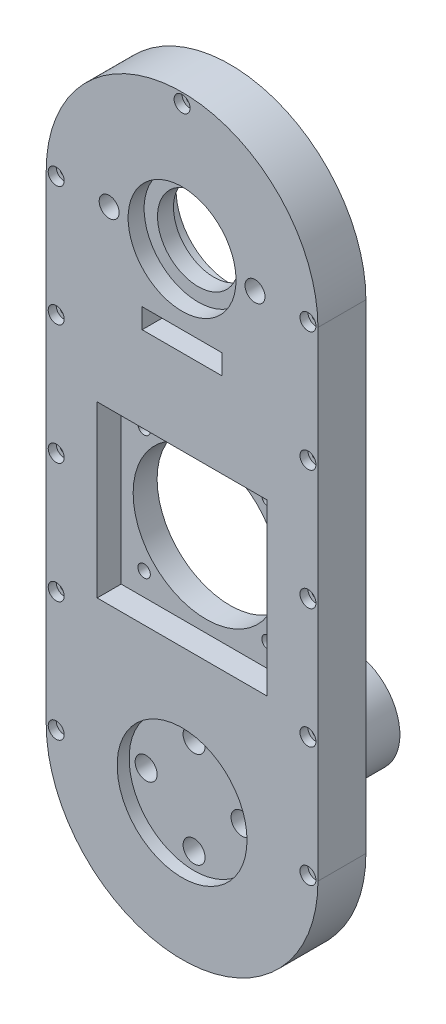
from build123d import *

# Parameters (mm, degrees)
BOSS_EXTRUDE1_DEPTH = 12
SKETCH2_R           = 16.25
CUT_EXTRUDE1_DEPTH  = 3
SKETCH3_R           = 2.75
CUT_EXTRUDE2_DEPTH  = 5
SKETCH4_R           = 12.5
BOSS_EXTRUDE2_DEPTH = 30
CUT_EXTRUDE9_REACH  = 110.425
SKETCH12_R          = 1.55
SKETCH12_R_2        = 18.25
SKETCH13_R          = 3
CUT_EXTRUDE10_DEPTH = 3
CUT_EXTRUDE11_REACH = 110.425
SKETCH14_R          = 10.15
SKETCH15_R          = 13.5
CUT_EXTRUDE12_DEPTH = 4
CUT_EXTRUDE17_REACH = 110.425
SKETCH19_R          = 1
CUT_EXTRUDE18_START = 12
SKETCH20_R          = 2
CUT_EXTRUDE18_DEPTH = 2
CUT_EXTRUDE19_REACH = 110.425
SKETCH21_R          = 2.5
SKETCH22_W          = 42.5
SKETCH22_H          = 42.5
CUT_EXTRUDE20_DEPTH = 6
CUT_EXTRUDE21_REACH = 106.365
SKETCH23_W          = 20
SKETCH23_H          = 5


with BuildPart() as part:
    # Sketch1 → Boss-Extrude1 (new body)
    with BuildSketch(Plane.XY):
        with BuildLine():
            Line((-34, -60), (-34, 60))
            ThreePointArc((-34, 60), (0, 94), (34, 60))
            Line((34, 60), (34, -60))
            ThreePointArc((34, -60), (0, -94), (-34, -60))
        make_face()
    extrude(amount=BOSS_EXTRUDE1_DEPTH)

    # Sketch2 → Cut-Extrude1 (cut)
    with BuildSketch(Plane.XY.offset(12)):
        with Locations((0, -60)):
            Circle(SKETCH2_R)
    extrude(amount=-CUT_EXTRUDE1_DEPTH, mode=Mode.SUBTRACT)

    # Sketch3 → Cut-Extrude2 (cut)
    with BuildSketch(Plane.XY.offset(9)):
        with Locations((0, -48)):
            Circle(SKETCH3_R)
        with Locations((12, -60)):
            Circle(SKETCH3_R)
        with Locations((0, -72)):
            Circle(SKETCH3_R)
        with Locations((-12, -60)):
            Circle(SKETCH3_R)
    extrude(amount=-CUT_EXTRUDE2_DEPTH, mode=Mode.SUBTRACT)

    # Sketch4 → Boss-Extrude2 (add)
    with BuildSketch(Plane(origin=(0, 0, 0), x_dir=(-1, 0, 0), z_dir=(0, 0, -1))):
        with Locations((0, -60)):
            Circle(SKETCH4_R)
    extrude(amount=BOSS_EXTRUDE2_DEPTH)

    # Sketch12 → Cut-Extrude9 (cut, up to next)
    with BuildSketch(Plane.XY.offset(12), mode=Mode.PRIVATE) as cut_extrude9_sk1:
        with Locations((-15.5, 10.5)):
            Circle(SKETCH12_R)
    cut_extrude9_tool1 = extrude(cut_extrude9_sk1.sketch, amount=-CUT_EXTRUDE9_REACH, mode=Mode.PRIVATE) & part.part
    # Sketch12 → Cut-Extrude9 (cut, up to next)
    with BuildSketch(Plane.XY.offset(12), mode=Mode.PRIVATE) as cut_extrude9_sk2:
        with Locations((15.5, 10.5)):
            Circle(SKETCH12_R)
    cut_extrude9_tool2 = extrude(cut_extrude9_sk2.sketch, amount=-CUT_EXTRUDE9_REACH, mode=Mode.PRIVATE) & part.part
    # Sketch12 → Cut-Extrude9 (cut, up to next)
    with BuildSketch(Plane.XY.offset(12), mode=Mode.PRIVATE) as cut_extrude9_sk3:
        with Locations((15.5, -20.5)):
            Circle(SKETCH12_R)
    cut_extrude9_tool3 = extrude(cut_extrude9_sk3.sketch, amount=-CUT_EXTRUDE9_REACH, mode=Mode.PRIVATE) & part.part
    # Sketch12 → Cut-Extrude9 (cut, up to next)
    with BuildSketch(Plane.XY.offset(12), mode=Mode.PRIVATE) as cut_extrude9_sk4:
        with Locations((-15.5, -20.5)):
            Circle(SKETCH12_R)
    cut_extrude9_tool4 = extrude(cut_extrude9_sk4.sketch, amount=-CUT_EXTRUDE9_REACH, mode=Mode.PRIVATE) & part.part
    # Sketch12 → Cut-Extrude9 (cut, up to next)
    with BuildSketch(Plane.XY.offset(12), mode=Mode.PRIVATE) as cut_extrude9_sk5:
        with Locations((0, -5)):
            Circle(SKETCH12_R_2)
    cut_extrude9_tool5 = extrude(cut_extrude9_sk5.sketch, amount=-CUT_EXTRUDE9_REACH, mode=Mode.PRIVATE) & part.part
    add(cut_extrude9_tool1.solids().sort_by_distance((-15.5, 10.5, 12))[0], mode=Mode.SUBTRACT)
    add(cut_extrude9_tool2.solids().sort_by_distance((15.5, 10.5, 12))[0], mode=Mode.SUBTRACT)
    add(cut_extrude9_tool3.solids().sort_by_distance((15.5, -20.5, 12))[0], mode=Mode.SUBTRACT)
    add(cut_extrude9_tool4.solids().sort_by_distance((-15.5, -20.5, 12))[0], mode=Mode.SUBTRACT)
    add(cut_extrude9_tool5.solids().sort_by_distance((0, -5, 12))[0], mode=Mode.SUBTRACT)

    # Sketch13 → Cut-Extrude10 (cut)
    with BuildSketch(Plane(origin=(0, 0, 0), x_dir=(-1, 0, 0), z_dir=(0, 0, -1))):
        with Locations((15.5, 10.5)):
            Circle(SKETCH13_R)
        with Locations((15.5, -20.5)):
            Circle(SKETCH13_R)
        with Locations((-15.5, -20.5)):
            Circle(SKETCH13_R)
        with Locations((-15.5, 10.5)):
            Circle(SKETCH13_R)
    extrude(amount=-CUT_EXTRUDE10_DEPTH, mode=Mode.SUBTRACT)

    # Sketch14 → Cut-Extrude11 (cut, up to next)
    with BuildSketch(Plane.XY.offset(12), mode=Mode.PRIVATE) as cut_extrude11_sk1:
        with Locations((0, 60)):
            Circle(SKETCH14_R)
    cut_extrude11_tool1 = extrude(cut_extrude11_sk1.sketch, amount=-CUT_EXTRUDE11_REACH, mode=Mode.PRIVATE) & part.part
    add(cut_extrude11_tool1.solids().sort_by_distance((0, 60, 12))[0], mode=Mode.SUBTRACT)

    # Sketch15 → Cut-Extrude12 (cut)
    with BuildSketch(Plane.XY.offset(12)):
        with Locations((0, 60)):
            Circle(SKETCH15_R)
    cut_extrude12 = extrude(amount=-CUT_EXTRUDE12_DEPTH, mode=Mode.SUBTRACT)

    # Mirror1: Cut-Extrude12 across plane
    add(cut_extrude12.mirror(Plane.XY.offset(6)), mode=Mode.SUBTRACT)

    # Sketch19 → Cut-Extrude17 (cut, up to next)
    with BuildSketch(Plane.XY.offset(12), mode=Mode.PRIVATE) as cut_extrude17_sk1:
        with Locations((0, 91.5)):
            Circle(SKETCH19_R)
    cut_extrude17_tool1 = extrude(cut_extrude17_sk1.sketch, amount=-CUT_EXTRUDE17_REACH, mode=Mode.PRIVATE) & part.part
    # Sketch19 → Cut-Extrude17 (cut, up to next)
    with BuildSketch(Plane.XY.offset(12), mode=Mode.PRIVATE) as cut_extrude17_sk2:
        with Locations((-31.5, 60)):
            Circle(SKETCH19_R)
    cut_extrude17_tool2 = extrude(cut_extrude17_sk2.sketch, amount=-CUT_EXTRUDE17_REACH, mode=Mode.PRIVATE) & part.part
    # Sketch19 → Cut-Extrude17 (cut, up to next)
    with BuildSketch(Plane.XY.offset(12), mode=Mode.PRIVATE) as cut_extrude17_sk3:
        with Locations((31.5, 60)):
            Circle(SKETCH19_R)
    cut_extrude17_tool3 = extrude(cut_extrude17_sk3.sketch, amount=-CUT_EXTRUDE17_REACH, mode=Mode.PRIVATE) & part.part
    # Sketch19 → Cut-Extrude17 (cut, up to next)
    with BuildSketch(Plane.XY.offset(12), mode=Mode.PRIVATE) as cut_extrude17_sk4:
        with Locations((31.5, 30)):
            Circle(SKETCH19_R)
    cut_extrude17_tool4 = extrude(cut_extrude17_sk4.sketch, amount=-CUT_EXTRUDE17_REACH, mode=Mode.PRIVATE) & part.part
    # Sketch19 → Cut-Extrude17 (cut, up to next)
    with BuildSketch(Plane.XY.offset(12), mode=Mode.PRIVATE) as cut_extrude17_sk5:
        with Locations((31.5, 0)):
            Circle(SKETCH19_R)
    cut_extrude17_tool5 = extrude(cut_extrude17_sk5.sketch, amount=-CUT_EXTRUDE17_REACH, mode=Mode.PRIVATE) & part.part
    # Sketch19 → Cut-Extrude17 (cut, up to next)
    with BuildSketch(Plane.XY.offset(12), mode=Mode.PRIVATE) as cut_extrude17_sk6:
        with Locations((31.5, -30)):
            Circle(SKETCH19_R)
    cut_extrude17_tool6 = extrude(cut_extrude17_sk6.sketch, amount=-CUT_EXTRUDE17_REACH, mode=Mode.PRIVATE) & part.part
    # Sketch19 → Cut-Extrude17 (cut, up to next)
    with BuildSketch(Plane.XY.offset(12), mode=Mode.PRIVATE) as cut_extrude17_sk7:
        with Locations((-31.5, 30)):
            Circle(SKETCH19_R)
    cut_extrude17_tool7 = extrude(cut_extrude17_sk7.sketch, amount=-CUT_EXTRUDE17_REACH, mode=Mode.PRIVATE) & part.part
    # Sketch19 → Cut-Extrude17 (cut, up to next)
    with BuildSketch(Plane.XY.offset(12), mode=Mode.PRIVATE) as cut_extrude17_sk8:
        with Locations((-31.5, 0)):
            Circle(SKETCH19_R)
    cut_extrude17_tool8 = extrude(cut_extrude17_sk8.sketch, amount=-CUT_EXTRUDE17_REACH, mode=Mode.PRIVATE) & part.part
    # Sketch19 → Cut-Extrude17 (cut, up to next)
    with BuildSketch(Plane.XY.offset(12), mode=Mode.PRIVATE) as cut_extrude17_sk9:
        with Locations((-31.5, -30)):
            Circle(SKETCH19_R)
    cut_extrude17_tool9 = extrude(cut_extrude17_sk9.sketch, amount=-CUT_EXTRUDE17_REACH, mode=Mode.PRIVATE) & part.part
    add(cut_extrude17_tool1.solids().sort_by_distance((0, 91.5, 12))[0], mode=Mode.SUBTRACT)
    add(cut_extrude17_tool2.solids().sort_by_distance((-31.5, 60, 12))[0], mode=Mode.SUBTRACT)
    add(cut_extrude17_tool3.solids().sort_by_distance((31.5, 60, 12))[0], mode=Mode.SUBTRACT)
    add(cut_extrude17_tool4.solids().sort_by_distance((31.5, 30, 12))[0], mode=Mode.SUBTRACT)
    add(cut_extrude17_tool5.solids().sort_by_distance((31.5, 0, 12))[0], mode=Mode.SUBTRACT)
    add(cut_extrude17_tool6.solids().sort_by_distance((31.5, -30, 12))[0], mode=Mode.SUBTRACT)
    add(cut_extrude17_tool7.solids().sort_by_distance((-31.5, 30, 12))[0], mode=Mode.SUBTRACT)
    add(cut_extrude17_tool8.solids().sort_by_distance((-31.5, 0, 12))[0], mode=Mode.SUBTRACT)
    add(cut_extrude17_tool9.solids().sort_by_distance((-31.5, -30, 12))[0], mode=Mode.SUBTRACT)

    # Sketch20 → Cut-Extrude18 (cut)
    with BuildSketch(Plane.XY.offset(CUT_EXTRUDE18_START)):
        with Locations(Location((0, 91.5, 0), (0, 0, 180))):
            Circle(SKETCH20_R)
        with Locations(Location((-31.5, 60, 0), (0, 0, 180))):
            Circle(SKETCH20_R)
        with Locations(Location((31.5, 60, 0), (0, 0, 180))):
            Circle(SKETCH20_R)
        with Locations(Location((31.5, 30, 0), (0, 0, 180))):
            Circle(SKETCH20_R)
        with Locations(Location((31.5, 0, 0), (0, 0, 180))):
            Circle(SKETCH20_R)
        with Locations(Location((31.5, -30, 0), (0, 0, 180))):
            Circle(SKETCH20_R)
        with Locations(Location((31.5, -60, 0), (0, 0, 180))):
            Circle(SKETCH20_R)
        with Locations(Location((-31.5, 30, 0), (0, 0, 180))):
            Circle(SKETCH20_R)
        with Locations(Location((-31.5, 0, 0), (0, 0, 180))):
            Circle(SKETCH20_R)
        with Locations(Location((-31.5, -30, 0), (0, 0, 180))):
            Circle(SKETCH20_R)
        with Locations(Location((-31.5, -60, 0), (0, 0, 180))):
            Circle(SKETCH20_R)
    extrude(amount=-CUT_EXTRUDE18_DEPTH, mode=Mode.SUBTRACT)

    # Sketch21 → Cut-Extrude19 (cut, up to next)
    with BuildSketch(Plane.XY.offset(12), mode=Mode.PRIVATE) as cut_extrude19_sk1:
        with Locations((-18.25, 60)):
            Circle(SKETCH21_R)
    cut_extrude19_tool1 = extrude(cut_extrude19_sk1.sketch, amount=-CUT_EXTRUDE19_REACH, mode=Mode.PRIVATE) & part.part
    # Sketch21 → Cut-Extrude19 (cut, up to next)
    with BuildSketch(Plane.XY.offset(12), mode=Mode.PRIVATE) as cut_extrude19_sk2:
        with Locations((18.25, 60)):
            Circle(SKETCH21_R)
    cut_extrude19_tool2 = extrude(cut_extrude19_sk2.sketch, amount=-CUT_EXTRUDE19_REACH, mode=Mode.PRIVATE) & part.part
    add(cut_extrude19_tool1.solids().sort_by_distance((-18.25, 60, 12))[0], mode=Mode.SUBTRACT)
    add(cut_extrude19_tool2.solids().sort_by_distance((18.25, 60, 12))[0], mode=Mode.SUBTRACT)

    # Sketch22 → Cut-Extrude20 (cut)
    with BuildSketch(Plane.XY.offset(12)):
        with Locations((0, -5)):
            Rectangle(SKETCH22_W, SKETCH22_H)
    extrude(amount=-CUT_EXTRUDE20_DEPTH, mode=Mode.SUBTRACT)

    # Sketch23 → Cut-Extrude21 (cut, up to next)
    with BuildSketch(Plane(origin=(0, 0, 0), x_dir=(-1, 0, 0), z_dir=(0, 0, -1)), mode=Mode.PRIVATE) as cut_extrude21_sk1:
        with Locations((0, 40)):
            Rectangle(SKETCH23_W, SKETCH23_H)
    cut_extrude21_tool1 = extrude(cut_extrude21_sk1.sketch, amount=-CUT_EXTRUDE21_REACH, mode=Mode.PRIVATE) & part.part
    add(cut_extrude21_tool1.solids().sort_by_distance((0, 40, 0))[0], mode=Mode.SUBTRACT)


solid = part.part
